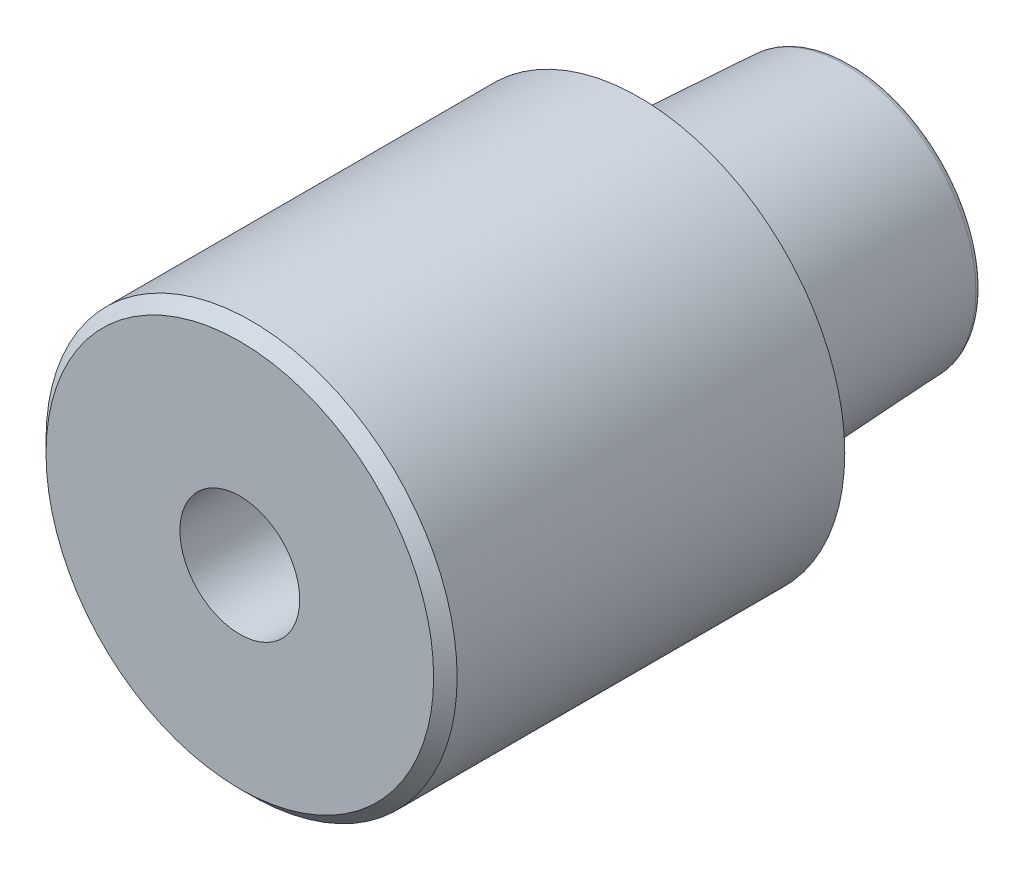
ISO-10303-21;
HEADER;
FILE_DESCRIPTION(('STEP AP214'),'2;1');
FILE_NAME('part.step','',(''),(''),'','','');
FILE_SCHEMA(('AUTOMOTIVE_DESIGN { 1 0 10303 214 1 1 1 1 }'));
ENDSEC;
DATA;
#1=APPLICATION_CONTEXT('core data for automotive mechanical design processes');
#2=APPLICATION_PROTOCOL_DEFINITION('international standard','automotive_design',2000,#1);
#3=PRODUCT_CONTEXT('',#1,'mechanical');
#4=PRODUCT('Part','Part','',(#3));
#5=PRODUCT_RELATED_PRODUCT_CATEGORY('part','',(#4));
#6=PRODUCT_DEFINITION_FORMATION('','',#4);
#7=PRODUCT_DEFINITION_CONTEXT('part definition',#1,'design');
#8=PRODUCT_DEFINITION('design','',#6,#7);
#9=PRODUCT_DEFINITION_SHAPE('','',#8);
#10=(LENGTH_UNIT() NAMED_UNIT(*) SI_UNIT(.MILLI.,.METRE.));
#11=(NAMED_UNIT(*) PLANE_ANGLE_UNIT() SI_UNIT($,.RADIAN.));
#12=(NAMED_UNIT(*) SI_UNIT($,.STERADIAN.) SOLID_ANGLE_UNIT());
#13=UNCERTAINTY_MEASURE_WITH_UNIT(LENGTH_MEASURE(1.E-05),#10,'distance_accuracy_value','');
#14=(GEOMETRIC_REPRESENTATION_CONTEXT(3) GLOBAL_UNCERTAINTY_ASSIGNED_CONTEXT((#13)) GLOBAL_UNIT_ASSIGNED_CONTEXT((#10,
#11,#12)) REPRESENTATION_CONTEXT('',''));
#15=CARTESIAN_POINT('',(0.,0.,0.));
#16=DIRECTION('',(0.,0.,1.));
#17=DIRECTION('',(1.,0.,0.));
#18=AXIS2_PLACEMENT_3D('',#15,#16,#17);
#19=CARTESIAN_POINT('',(1.86803068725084E-13,0.,26.7512626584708));
#20=DIRECTION('',(0.,0.,-1.));
#21=DIRECTION('',(1.,0.,0.));
#22=AXIS2_PLACEMENT_3D('',#19,#20,#21);
#23=CONICAL_SURFACE('',#22,24.7487373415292,0.785398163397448);
#24=CARTESIAN_POINT('',(2.4440369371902E-13,0.,35.));
#25=DIRECTION('',(0.,0.,-1.));
#26=DIRECTION('',(-1.,0.,0.));
#27=AXIS2_PLACEMENT_3D('',#24,#25,#26);
#28=CIRCLE('',#27,16.5);
#29=CARTESIAN_POINT('',(-16.4999999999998,0.,35.));
#30=VERTEX_POINT('',#29);
#31=CARTESIAN_POINT('',(16.5000000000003,0.,35.));
#32=VERTEX_POINT('',#31);
#33=EDGE_CURVE('E59',#30,#32,#28,.T.);
#34=ORIENTED_EDGE('',*,*,#33,.T.);
#35=CARTESIAN_POINT('',(16.4999992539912,0.,35.0000007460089));
#36=CARTESIAN_POINT('',(17.4999995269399,0.,34.0000004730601));
#37=B_SPLINE_CURVE_WITH_KNOTS('',1,(#35,#36),.UNSPECIFIED.,.F.,.F.,(2,2),(0.666700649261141,
0.707106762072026),.UNSPECIFIED.);
#38=CARTESIAN_POINT('',(17.5000000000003,0.,34.));
#39=VERTEX_POINT('',#38);
#40=EDGE_CURVE('E46',#32,#39,#37,.T.);
#41=ORIENTED_EDGE('',*,*,#40,.T.);
#42=CARTESIAN_POINT('',(2.37420731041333E-13,0.,34.));
#43=DIRECTION('',(0.,0.,1.));
#44=DIRECTION('',(-1.,0.,0.));
#45=AXIS2_PLACEMENT_3D('',#42,#43,#44);
#46=CIRCLE('',#45,17.5);
#47=CARTESIAN_POINT('',(-17.4999999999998,0.,34.));
#48=VERTEX_POINT('',#47);
#49=EDGE_CURVE('E97',#39,#48,#46,.T.);
#50=ORIENTED_EDGE('',*,*,#49,.T.);
#51=CARTESIAN_POINT('',(2.37420731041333E-13,0.,34.));
#52=DIRECTION('',(0.,0.,1.));
#53=DIRECTION('',(-1.,0.,0.));
#54=AXIS2_PLACEMENT_3D('',#51,#52,#53);
#55=CIRCLE('',#54,17.5);
#56=EDGE_CURVE('E11',#48,#39,#55,.T.);
#57=ORIENTED_EDGE('',*,*,#56,.T.);
#58=ORIENTED_EDGE('',*,*,#40,.F.);
#59=CARTESIAN_POINT('',(2.4440369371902E-13,0.,35.));
#60=DIRECTION('',(0.,0.,-1.));
#61=DIRECTION('',(-1.,0.,0.));
#62=AXIS2_PLACEMENT_3D('',#59,#60,#61);
#63=CIRCLE('',#62,16.5);
#64=EDGE_CURVE('E94',#32,#30,#63,.T.);
#65=ORIENTED_EDGE('',*,*,#64,.T.);
#66=EDGE_LOOP('',(#34,#41,#50,#57,#58,#65));
#67=FACE_BOUND('',#66,.T.);
#68=ADVANCED_FACE('F38',(#67),#23,.T.);
#69=CARTESIAN_POINT('',(1.25693328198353E-13,0.,18.));
#70=DIRECTION('',(0.,0.,-1.));
#71=DIRECTION('',(-1.,0.,0.));
#72=AXIS2_PLACEMENT_3D('',#69,#70,#71);
#73=CYLINDRICAL_SURFACE('',#72,17.5);
#74=ORIENTED_EDGE('',*,*,#49,.F.);
#75=ORIENTED_EDGE('',*,*,#56,.F.);
#76=CARTESIAN_POINT('',(-17.4999999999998,0.,34.0000012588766));
#77=CARTESIAN_POINT('',(-17.5,0.,1.00000042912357));
#78=B_SPLINE_CURVE_WITH_KNOTS('',1,(#76,#77),.UNSPECIFIED.,.F.,.F.,(2,2),(0.0833333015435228,
0.916666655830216),.UNSPECIFIED.);
#79=CARTESIAN_POINT('',(-17.5,0.,1.00000000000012));
#80=VERTEX_POINT('',#79);
#81=EDGE_CURVE('E132',#48,#80,#78,.T.);
#82=ORIENTED_EDGE('',*,*,#81,.T.);
#83=CARTESIAN_POINT('',(0.,0.,1.));
#84=DIRECTION('',(0.,0.,-1.));
#85=DIRECTION('',(-1.,0.,0.));
#86=AXIS2_PLACEMENT_3D('',#83,#84,#85);
#87=CIRCLE('',#86,17.5);
#88=EDGE_CURVE('E137',#80,#80,#87,.T.);
#89=ORIENTED_EDGE('',*,*,#88,.F.);
#90=ORIENTED_EDGE('',*,*,#81,.F.);
#91=EDGE_LOOP('',(#74,#75,#82,#89,#90));
#92=FACE_BOUND('',#91,.T.);
#93=ADVANCED_FACE('F182',(#92),#73,.T.);
#94=CARTESIAN_POINT('',(-21.4499999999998,-34.2946059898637,35.));
#95=DIRECTION('',(0.,0.,1.));
#96=DIRECTION('',(1.,0.,0.));
#97=AXIS2_PLACEMENT_3D('',#94,#95,#96);
#98=PLANE('',#97);
#99=CARTESIAN_POINT('',(0.,0.,34.9999999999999));
#100=DIRECTION('',(0.,0.,1.));
#101=DIRECTION('',(1.,0.,0.));
#102=AXIS2_PLACEMENT_3D('',#99,#100,#101);
#103=CIRCLE('',#102,5.09999999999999);
#104=CARTESIAN_POINT('',(5.09999999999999,0.,34.9999999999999));
#105=VERTEX_POINT('',#104);
#106=EDGE_CURVE('E95',#105,#105,#103,.T.);
#107=ORIENTED_EDGE('',*,*,#106,.F.);
#108=EDGE_LOOP('',(#107));
#109=FACE_BOUND('',#108,.T.);
#110=ORIENTED_EDGE('',*,*,#64,.F.);
#111=ORIENTED_EDGE('',*,*,#33,.F.);
#112=EDGE_LOOP('',(#110,#111));
#113=FACE_BOUND('',#112,.T.);
#114=ADVANCED_FACE('F185',(#109,#113),#98,.T.);
#115=CARTESIAN_POINT('',(-1.15218884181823E-13,0.,-16.5));
#116=DIRECTION('',(0.,0.,-1.));
#117=DIRECTION('',(-1.,0.,0.));
#118=AXIS2_PLACEMENT_3D('',#115,#116,#117);
#119=TOROIDAL_SURFACE('',#118,10.6345854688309,0.5);
#120=CARTESIAN_POINT('',(-1.15401614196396E-13,0.,-16.5261679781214));
#121=DIRECTION('',(0.,0.,-1.));
#122=DIRECTION('',(-1.,0.,0.));
#123=AXIS2_PLACEMENT_3D('',#120,#121,#122);
#124=CIRCLE('',#123,11.1339002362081);
#125=CARTESIAN_POINT('',(-11.1339002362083,0.,-16.5261679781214));
#126=VERTEX_POINT('',#125);
#127=EDGE_CURVE('E138',#126,#126,#124,.T.);
#128=ORIENTED_EDGE('',*,*,#127,.T.);
#129=CARTESIAN_POINT('',(-11.1339002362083,0.,-16.5261679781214));
#130=CARTESIAN_POINT('',(-11.1090677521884,0.,-16.9999999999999));
#131=CARTESIAN_POINT('',(-10.634585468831,0.,-17.));
#132=(BOUNDED_CURVE() B_SPLINE_CURVE(2,(#129,#130,#131),.UNSPECIFIED.,.F.,
.F.) B_SPLINE_CURVE_WITH_KNOTS((3,3),(0.,0.5),
.UNSPECIFIED.) CURVE() GEOMETRIC_REPRESENTATION_ITEM() RATIONAL_B_SPLINE_CURVE((1.,
0.725374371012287,1.)) REPRESENTATION_ITEM(''));
#133=CARTESIAN_POINT('',(-10.634585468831,0.,-17.));
#134=VERTEX_POINT('',#133);
#135=EDGE_CURVE('E121',#126,#134,#132,.T.);
#136=ORIENTED_EDGE('',*,*,#135,.T.);
#137=CARTESIAN_POINT('',(-1.18710365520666E-13,0.,-17.));
#138=DIRECTION('',(0.,0.,1.));
#139=DIRECTION('',(-1.,0.,0.));
#140=AXIS2_PLACEMENT_3D('',#137,#138,#139);
#141=CIRCLE('',#140,10.6345854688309);
#142=EDGE_CURVE('E127',#134,#134,#141,.T.);
#143=ORIENTED_EDGE('',*,*,#142,.T.);
#144=ORIENTED_EDGE('',*,*,#135,.F.);
#145=EDGE_LOOP('',(#128,#136,#143,#144));
#146=FACE_BOUND('',#145,.T.);
#147=ADVANCED_FACE('F187',(#146),#119,.T.);
#148=CARTESIAN_POINT('',(0.,0.,0.));
#149=DIRECTION('',(0.,0.,1.));
#150=DIRECTION('',(-1.,0.,0.));
#151=AXIS2_PLACEMENT_3D('',#148,#149,#150);
#152=CONICAL_SURFACE('',#151,12.,0.0523598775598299);
#153=ORIENTED_EDGE('',*,*,#127,.F.);
#154=CARTESIAN_POINT('',(-11.1339002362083,0.,-16.5261679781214));
#155=CARTESIAN_POINT('',(-12.,0.,0.));
#156=B_SPLINE_CURVE_WITH_KNOTS('',1,(#154,#155),.UNSPECIFIED.,.F.,.F.,(2,2),(0.,1.),.UNSPECIFIED.);
#157=CARTESIAN_POINT('',(-12.,0.,0.));
#158=VERTEX_POINT('',#157);
#159=EDGE_CURVE('E110',#126,#158,#156,.T.);
#160=ORIENTED_EDGE('',*,*,#159,.T.);
#161=CARTESIAN_POINT('',(0.,0.,0.));
#162=DIRECTION('',(0.,0.,-1.));
#163=DIRECTION('',(-1.,0.,0.));
#164=AXIS2_PLACEMENT_3D('',#161,#162,#163);
#165=CIRCLE('',#164,12.);
#166=EDGE_CURVE('E116',#158,#158,#165,.T.);
#167=ORIENTED_EDGE('',*,*,#166,.T.);
#168=ORIENTED_EDGE('',*,*,#159,.F.);
#169=EDGE_LOOP('',(#153,#160,#167,#168));
#170=FACE_BOUND('',#169,.T.);
#171=ADVANCED_FACE('F194',(#170),#152,.T.);
#172=CARTESIAN_POINT('',(24.4595465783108,-22.1035708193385,-17.));
#173=DIRECTION('',(0.,0.,-1.));
#174=DIRECTION('',(-1.,0.,0.));
#175=AXIS2_PLACEMENT_3D('',#172,#173,#174);
#176=PLANE('',#175);
#177=ORIENTED_EDGE('',*,*,#142,.F.);
#178=EDGE_LOOP('',(#177));
#179=FACE_BOUND('',#178,.T.);
#180=ADVANCED_FACE('F222',(#179),#176,.T.);
#181=CARTESIAN_POINT('',(0.,0.,0.5));
#182=DIRECTION('',(0.,0.,-1.));
#183=DIRECTION('',(-1.,0.,0.));
#184=AXIS2_PLACEMENT_3D('',#181,#182,#183);
#185=CYLINDRICAL_SURFACE('',#184,12.);
#186=CARTESIAN_POINT('',(0.,0.,1.));
#187=DIRECTION('',(0.,0.,1.));
#188=DIRECTION('',(-1.,0.,0.));
#189=AXIS2_PLACEMENT_3D('',#186,#187,#188);
#190=CIRCLE('',#189,12.);
#191=CARTESIAN_POINT('',(-12.,0.,1.00000000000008));
#192=VERTEX_POINT('',#191);
#193=EDGE_CURVE('E105',#192,#192,#190,.T.);
#194=ORIENTED_EDGE('',*,*,#193,.F.);
#195=CARTESIAN_POINT('',(-12.,0.,1.0000030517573));
#196=CARTESIAN_POINT('',(-12.,0.,5.31746959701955E-07));
#197=B_SPLINE_CURVE_WITH_KNOTS('',1,(#195,#196),.UNSPECIFIED.,.F.,.F.,(2,2),(0.0833307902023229,
0.91666622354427),.UNSPECIFIED.);
#198=EDGE_CURVE('E102',#192,#158,#197,.T.);
#199=ORIENTED_EDGE('',*,*,#198,.T.);
#200=ORIENTED_EDGE('',*,*,#166,.F.);
#201=ORIENTED_EDGE('',*,*,#198,.F.);
#202=EDGE_LOOP('',(#194,#199,#200,#201));
#203=FACE_BOUND('',#202,.T.);
#204=ADVANCED_FACE('F231',(#203),#185,.T.);
#205=CARTESIAN_POINT('',(40.25,-36.3730669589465,0.999999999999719));
#206=DIRECTION('',(0.,0.,-1.));
#207=DIRECTION('',(-1.,0.,0.));
#208=AXIS2_PLACEMENT_3D('',#205,#206,#207);
#209=PLANE('',#208);
#210=ORIENTED_EDGE('',*,*,#88,.T.);
#211=EDGE_LOOP('',(#210));
#212=FACE_BOUND('',#211,.T.);
#213=ORIENTED_EDGE('',*,*,#193,.T.);
#214=EDGE_LOOP('',(#213));
#215=FACE_BOUND('',#214,.T.);
#216=ADVANCED_FACE('F88',(#212,#215),#209,.T.);
#217=CARTESIAN_POINT('',(0.,0.,8.99999999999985));
#218=DIRECTION('',(0.,0.,1.));
#219=DIRECTION('',(1.,0.,0.));
#220=AXIS2_PLACEMENT_3D('',#217,#218,#219);
#221=CONICAL_SURFACE('',#220,5.09999999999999,1.02974425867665);
#222=CARTESIAN_POINT('',(0.,0.,5.93561084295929));
#223=VERTEX_POINT('',#222);
#224=VERTEX_LOOP('',#223);
#225=FACE_BOUND('',#224,.T.);
#226=CARTESIAN_POINT('',(0.,0.,8.99999999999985));
#227=DIRECTION('',(0.,0.,1.));
#228=DIRECTION('',(1.,0.,0.));
#229=AXIS2_PLACEMENT_3D('',#226,#227,#228);
#230=CIRCLE('',#229,5.09999999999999);
#231=CARTESIAN_POINT('',(5.09999999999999,0.,8.99999999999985));
#232=VERTEX_POINT('',#231);
#233=EDGE_CURVE('E92',#232,#232,#230,.T.);
#234=ORIENTED_EDGE('',*,*,#233,.T.);
#235=EDGE_LOOP('',(#234));
#236=FACE_BOUND('',#235,.T.);
#237=ADVANCED_FACE('F84',(#225,#236),#221,.F.);
#238=CARTESIAN_POINT('',(0.,0.,34.9999999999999));
#239=DIRECTION('',(0.,0.,1.));
#240=DIRECTION('',(1.,0.,0.));
#241=AXIS2_PLACEMENT_3D('',#238,#239,#240);
#242=CYLINDRICAL_SURFACE('',#241,5.09999999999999);
#243=ORIENTED_EDGE('',*,*,#233,.F.);
#244=EDGE_LOOP('',(#243));
#245=FACE_BOUND('',#244,.T.);
#246=ORIENTED_EDGE('',*,*,#106,.T.);
#247=EDGE_LOOP('',(#246));
#248=FACE_BOUND('',#247,.T.);
#249=ADVANCED_FACE('F87',(#245,#248),#242,.F.);
#250=CLOSED_SHELL('',(#68,#93,#114,#147,#171,#180,#204,#216,#237,#249));
#251=MANIFOLD_SOLID_BREP('B2',#250);
#252=ADVANCED_BREP_SHAPE_REPRESENTATION('',(#18,#251),#14);
#253=SHAPE_DEFINITION_REPRESENTATION(#9,#252);
ENDSEC;
END-ISO-10303-21;
